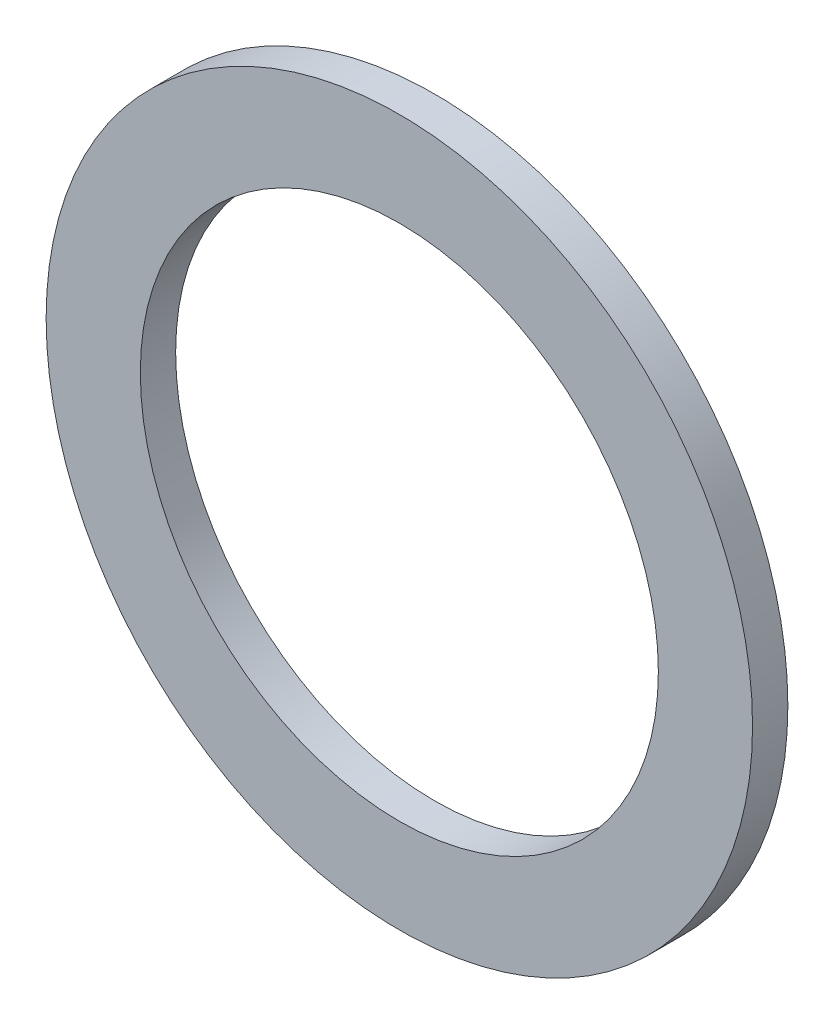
from build123d import *

# Parameters (mm, degrees)
ESQUISSE1_R          = 30
ESQUISSE1_R_2        = 22
BASE_EXTRUSION_DEPTH = 3


with BuildPart() as part:
    # Esquisse1 → Base-Extrusion (new body)
    with BuildSketch(Plane.XY):
        Circle(ESQUISSE1_R)
        Circle(ESQUISSE1_R_2, mode=Mode.SUBTRACT)
    extrude(amount=BASE_EXTRUSION_DEPTH)


solid = part.part
